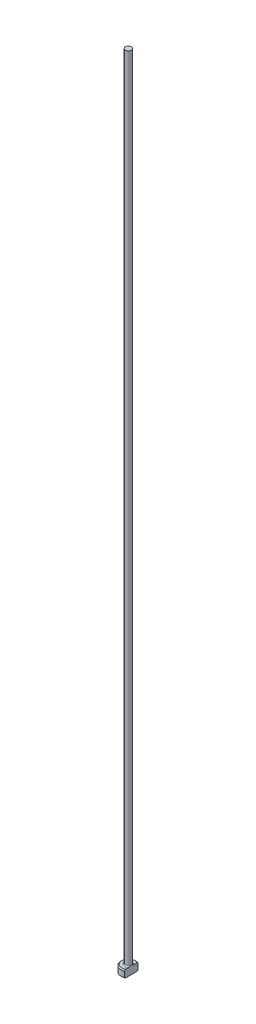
ISO-10303-21;
HEADER;
FILE_DESCRIPTION(('STEP AP214'),'2;1');
FILE_NAME('part.step','',(''),(''),'','','');
FILE_SCHEMA(('AUTOMOTIVE_DESIGN { 1 0 10303 214 1 1 1 1 }'));
ENDSEC;
DATA;
#1=APPLICATION_CONTEXT('core data for automotive mechanical design processes');
#2=APPLICATION_PROTOCOL_DEFINITION('international standard','automotive_design',2000,#1);
#3=PRODUCT_CONTEXT('',#1,'mechanical');
#4=PRODUCT('Part','Part','',(#3));
#5=PRODUCT_RELATED_PRODUCT_CATEGORY('part','',(#4));
#6=PRODUCT_DEFINITION_FORMATION('','',#4);
#7=PRODUCT_DEFINITION_CONTEXT('part definition',#1,'design');
#8=PRODUCT_DEFINITION('design','',#6,#7);
#9=PRODUCT_DEFINITION_SHAPE('','',#8);
#10=(LENGTH_UNIT() NAMED_UNIT(*) SI_UNIT(.MILLI.,.METRE.));
#11=(NAMED_UNIT(*) PLANE_ANGLE_UNIT() SI_UNIT($,.RADIAN.));
#12=(NAMED_UNIT(*) SI_UNIT($,.STERADIAN.) SOLID_ANGLE_UNIT());
#13=UNCERTAINTY_MEASURE_WITH_UNIT(LENGTH_MEASURE(1.E-05),#10,'distance_accuracy_value','');
#14=(GEOMETRIC_REPRESENTATION_CONTEXT(3) GLOBAL_UNCERTAINTY_ASSIGNED_CONTEXT((#13)) GLOBAL_UNIT_ASSIGNED_CONTEXT((#10,
#11,#12)) REPRESENTATION_CONTEXT('',''));
#15=CARTESIAN_POINT('',(0.,0.,0.));
#16=DIRECTION('',(0.,0.,1.));
#17=DIRECTION('',(1.,0.,0.));
#18=AXIS2_PLACEMENT_3D('',#15,#16,#17);
#19=CARTESIAN_POINT('',(0.,0.,0.));
#20=DIRECTION('',(0.,-1.,0.));
#21=DIRECTION('',(0.,0.,-1.));
#22=AXIS2_PLACEMENT_3D('',#19,#20,#21);
#23=PLANE('',#22);
#24=CARTESIAN_POINT('',(0.,0.,0.));
#25=DIRECTION('',(0.,-1.,0.));
#26=DIRECTION('',(0.,0.,-1.));
#27=AXIS2_PLACEMENT_3D('',#24,#25,#26);
#28=CIRCLE('',#27,1.29999999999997);
#29=CARTESIAN_POINT('',(0.599999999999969,0.,1.15325625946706));
#30=VERTEX_POINT('',#29);
#31=CARTESIAN_POINT('',(0.599999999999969,0.,-1.15325625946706));
#32=VERTEX_POINT('',#31);
#33=EDGE_CURVE('E98',#30,#32,#28,.T.);
#34=ORIENTED_EDGE('',*,*,#33,.T.);
#35=DIRECTION('',(0.,0.,1.));
#36=VECTOR('',#35,1.);
#37=CARTESIAN_POINT('',(0.599999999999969,0.,-1.37477270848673));
#38=LINE('',#37,#36);
#39=EDGE_CURVE('E83',#32,#30,#38,.T.);
#40=ORIENTED_EDGE('',*,*,#39,.T.);
#41=EDGE_LOOP('',(#34,#40));
#42=FACE_BOUND('',#41,.T.);
#43=ADVANCED_FACE('F32',(#42),#23,.T.);
#44=CARTESIAN_POINT('',(0.,259.958771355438,0.));
#45=DIRECTION('',(0.,1.,0.));
#46=DIRECTION('',(0.,0.,1.));
#47=AXIS2_PLACEMENT_3D('',#44,#45,#46);
#48=CYLINDRICAL_SURFACE('',#47,1.49999999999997);
#49=CARTESIAN_POINT('',(0.,1.30000000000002,0.));
#50=DIRECTION('',(0.,1.,0.));
#51=DIRECTION('',(0.,0.,1.));
#52=AXIS2_PLACEMENT_3D('',#49,#50,#51);
#53=CIRCLE('',#52,1.49999999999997);
#54=CARTESIAN_POINT('',(0.599999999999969,1.30000000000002,1.37477270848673));
#55=VERTEX_POINT('',#54);
#56=CARTESIAN_POINT('',(0.599999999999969,1.30000000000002,-1.37477270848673));
#57=VERTEX_POINT('',#56);
#58=EDGE_CURVE('E104',#55,#57,#53,.F.);
#59=ORIENTED_EDGE('',*,*,#58,.T.);
#60=DIRECTION('',(0.,-1.,0.));
#61=VECTOR('',#60,1.);
#62=CARTESIAN_POINT('',(0.599999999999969,160.,-1.37477270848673));
#63=LINE('',#62,#61);
#64=CARTESIAN_POINT('',(0.599999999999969,0.200000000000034,-1.37477270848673));
#65=VERTEX_POINT('',#64);
#66=EDGE_CURVE('E183',#57,#65,#63,.T.);
#67=ORIENTED_EDGE('',*,*,#66,.T.);
#68=CARTESIAN_POINT('',(0.,0.200000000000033,0.));
#69=DIRECTION('',(0.,-1.,0.));
#70=DIRECTION('',(0.,0.,-1.));
#71=AXIS2_PLACEMENT_3D('',#68,#69,#70);
#72=CIRCLE('',#71,1.49999999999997);
#73=CARTESIAN_POINT('',(0.599999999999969,0.200000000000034,1.37477270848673));
#74=VERTEX_POINT('',#73);
#75=EDGE_CURVE('E100',#65,#74,#72,.F.);
#76=ORIENTED_EDGE('',*,*,#75,.T.);
#77=DIRECTION('',(0.,-1.,0.));
#78=VECTOR('',#77,1.);
#79=CARTESIAN_POINT('',(0.599999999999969,160.,1.37477270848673));
#80=LINE('',#79,#78);
#81=EDGE_CURVE('E93',#55,#74,#80,.T.);
#82=ORIENTED_EDGE('',*,*,#81,.F.);
#83=EDGE_LOOP('',(#59,#67,#76,#82));
#84=FACE_BOUND('',#83,.T.);
#85=ADVANCED_FACE('F158',(#84),#48,.T.);
#86=CARTESIAN_POINT('',(-1.49999999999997,1.5,0.));
#87=DIRECTION('',(0.,1.,0.));
#88=DIRECTION('',(0.,0.,1.));
#89=AXIS2_PLACEMENT_3D('',#86,#87,#88);
#90=PLANE('',#89);
#91=CARTESIAN_POINT('',(0.,1.5,0.));
#92=DIRECTION('',(0.,1.,0.));
#93=DIRECTION('',(0.,0.,1.));
#94=AXIS2_PLACEMENT_3D('',#91,#92,#93);
#95=CIRCLE('',#94,1.29999999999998);
#96=CARTESIAN_POINT('',(0.599999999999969,1.5,-1.15325625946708));
#97=VERTEX_POINT('',#96);
#98=CARTESIAN_POINT('',(0.599999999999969,1.5,1.15325625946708));
#99=VERTEX_POINT('',#98);
#100=EDGE_CURVE('E178',#97,#99,#95,.T.);
#101=ORIENTED_EDGE('',*,*,#100,.T.);
#102=DIRECTION('',(0.,0.,-1.));
#103=VECTOR('',#102,1.);
#104=CARTESIAN_POINT('',(0.599999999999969,1.5,0.));
#105=LINE('',#104,#103);
#106=CARTESIAN_POINT('',(0.599999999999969,1.49999999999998,0.529150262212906));
#107=VERTEX_POINT('',#106);
#108=EDGE_CURVE('E57',#99,#107,#105,.T.);
#109=ORIENTED_EDGE('',*,*,#108,.T.);
#110=CARTESIAN_POINT('',(0.,1.5,0.));
#111=DIRECTION('',(0.,1.,0.));
#112=DIRECTION('',(0.,0.,1.));
#113=AXIS2_PLACEMENT_3D('',#110,#111,#112);
#114=CIRCLE('',#113,0.799999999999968);
#115=CARTESIAN_POINT('',(0.599999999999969,1.49999999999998,-0.529150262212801));
#116=VERTEX_POINT('',#115);
#117=EDGE_CURVE('E107',#107,#116,#114,.F.);
#118=ORIENTED_EDGE('',*,*,#117,.T.);
#119=EDGE_CURVE('E136',#116,#97,#105,.T.);
#120=ORIENTED_EDGE('',*,*,#119,.T.);
#121=EDGE_LOOP('',(#101,#109,#118,#120));
#122=FACE_BOUND('',#121,.T.);
#123=ADVANCED_FACE('F147',(#122),#90,.T.);
#124=CARTESIAN_POINT('',(0.,1.5,0.));
#125=DIRECTION('',(0.,-1.,0.));
#126=DIRECTION('',(0.,0.,-1.));
#127=AXIS2_PLACEMENT_3D('',#124,#125,#126);
#128=CONICAL_SURFACE('',#127,1.29999999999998,0.785398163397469);
#129=ORIENTED_EDGE('',*,*,#58,.F.);
#130=CARTESIAN_POINT('',(0.599999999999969,-0.287911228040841,3.02905855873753));
#131=CARTESIAN_POINT('',(0.599999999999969,-0.213665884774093,2.9533675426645));
#132=CARTESIAN_POINT('',(0.599999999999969,-0.139470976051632,2.87762699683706));
#133=CARTESIAN_POINT('',(0.599999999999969,0.00889104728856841,2.72590281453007));
#134=CARTESIAN_POINT('',(0.599999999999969,0.0830579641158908,2.64991898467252));
#135=CARTESIAN_POINT('',(0.599999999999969,0.233054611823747,2.49590131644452));
#136=CARTESIAN_POINT('',(0.599999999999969,0.308880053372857,2.41786329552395));
#137=CARTESIAN_POINT('',(0.599999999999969,0.460177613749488,2.26166700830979));
#138=CARTESIAN_POINT('',(0.599999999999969,0.535650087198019,2.18350908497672));
#139=CARTESIAN_POINT('',(0.599999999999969,0.74759769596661,1.96314022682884));
#140=CARTESIAN_POINT('',(0.599999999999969,0.883715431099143,1.82058320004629));
#141=CARTESIAN_POINT('',(0.599999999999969,1.08677998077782,1.60489754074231));
#142=CARTESIAN_POINT('',(0.599999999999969,1.15447989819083,1.53247863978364));
#143=CARTESIAN_POINT('',(0.599999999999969,1.28906472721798,1.38697516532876));
#144=CARTESIAN_POINT('',(0.599999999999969,1.35595015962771,1.3138910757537));
#145=CARTESIAN_POINT('',(0.599999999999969,1.48698128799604,1.16833124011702));
#146=CARTESIAN_POINT('',(0.599999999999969,1.55115458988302,1.09588037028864));
#147=CARTESIAN_POINT('',(0.599999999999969,1.67776408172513,0.949120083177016));
#148=CARTESIAN_POINT('',(0.599999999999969,1.74019534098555,0.874806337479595));
#149=CARTESIAN_POINT('',(0.599999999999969,1.83074985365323,0.761537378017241));
#150=CARTESIAN_POINT('',(0.599999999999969,1.86026258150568,0.7236980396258));
#151=CARTESIAN_POINT('',(0.599999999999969,1.91795850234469,0.647023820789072));
#152=CARTESIAN_POINT('',(0.599999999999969,1.94614205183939,0.608189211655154));
#153=CARTESIAN_POINT('',(0.599999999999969,2.00040823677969,0.529306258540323));
#154=CARTESIAN_POINT('',(0.599999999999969,2.02649909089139,0.489263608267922));
#155=CARTESIAN_POINT('',(0.599999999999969,2.07554904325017,0.407318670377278));
#156=CARTESIAN_POINT('',(0.599999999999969,2.09851337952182,0.365419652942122));
#157=CARTESIAN_POINT('',(0.599999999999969,2.12324895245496,0.313139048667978));
#158=CARTESIAN_POINT('',(0.599999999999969,2.12747172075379,0.303913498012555));
#159=CARTESIAN_POINT('',(0.599999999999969,2.13565719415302,0.285343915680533));
#160=CARTESIAN_POINT('',(0.599999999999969,2.13961980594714,0.275999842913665));
#161=CARTESIAN_POINT('',(0.599999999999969,2.15107305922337,0.247792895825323));
#162=CARTESIAN_POINT('',(0.599999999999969,2.15813129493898,0.228750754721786));
#163=CARTESIAN_POINT('',(0.599999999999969,2.17074315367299,0.190486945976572));
#164=CARTESIAN_POINT('',(0.599999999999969,2.17631779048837,0.171272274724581));
#165=CARTESIAN_POINT('',(0.599999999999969,2.18584668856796,0.132432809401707));
#166=CARTESIAN_POINT('',(0.599999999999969,2.18980047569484,0.112807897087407));
#167=CARTESIAN_POINT('',(0.599999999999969,2.19592362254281,0.0728426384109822));
#168=CARTESIAN_POINT('',(0.599999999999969,2.19805268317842,0.0524959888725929));
#169=CARTESIAN_POINT('',(0.599999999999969,2.20023157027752,0.0116969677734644));
#170=CARTESIAN_POINT('',(0.599999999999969,2.20028214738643,-0.00875536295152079));
#171=CARTESIAN_POINT('',(0.599999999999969,2.19830107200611,-0.0495737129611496));
#172=CARTESIAN_POINT('',(0.599999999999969,2.19626778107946,-0.0699396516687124));
#173=CARTESIAN_POINT('',(0.599999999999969,2.19025850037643,-0.110389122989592));
#174=CARTESIAN_POINT('',(0.599999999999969,2.18628111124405,-0.130472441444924));
#175=CARTESIAN_POINT('',(0.599999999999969,2.16914542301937,-0.200965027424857));
#176=CARTESIAN_POINT('',(0.599999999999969,2.15130072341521,-0.250247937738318));
#177=CARTESIAN_POINT('',(0.599999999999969,2.119457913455,-0.32187429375));
#178=CARTESIAN_POINT('',(0.599999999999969,2.10794198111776,-0.345455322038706));
#179=CARTESIAN_POINT('',(0.599999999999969,2.08360220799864,-0.391937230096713));
#180=CARTESIAN_POINT('',(0.599999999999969,2.07077874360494,-0.414838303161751));
#181=CARTESIAN_POINT('',(0.599999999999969,2.02919739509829,-0.485443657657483));
#182=CARTESIAN_POINT('',(0.599999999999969,1.99871708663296,-0.532120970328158));
#183=CARTESIAN_POINT('',(0.599999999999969,1.93517364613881,-0.623699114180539));
#184=CARTESIAN_POINT('',(0.599999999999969,1.90210805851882,-0.668598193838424));
#185=CARTESIAN_POINT('',(0.599999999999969,1.83427181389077,-0.75726294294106));
#186=CARTESIAN_POINT('',(0.599999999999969,1.79949703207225,-0.801025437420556));
#187=CARTESIAN_POINT('',(0.599999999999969,1.72886323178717,-0.887669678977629));
#188=CARTESIAN_POINT('',(0.599999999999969,1.69300406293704,-0.930551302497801));
#189=CARTESIAN_POINT('',(0.599999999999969,1.58401668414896,-1.05861145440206));
#190=CARTESIAN_POINT('',(0.599999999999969,1.50977131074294,-1.1428361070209));
#191=CARTESIAN_POINT('',(0.599999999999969,1.35983766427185,-1.30972078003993));
#192=CARTESIAN_POINT('',(0.599999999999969,1.28415199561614,-1.39238316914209));
#193=CARTESIAN_POINT('',(0.599999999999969,1.0847319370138,-1.60770200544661));
#194=CARTESIAN_POINT('',(0.599999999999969,0.960236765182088,-1.73965289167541));
#195=CARTESIAN_POINT('',(0.599999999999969,0.709941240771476,-2.00247228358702));
#196=CARTESIAN_POINT('',(0.599999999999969,0.584140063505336,-2.1333399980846));
#197=CARTESIAN_POINT('',(0.599999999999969,0.334155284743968,-2.39196201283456));
#198=CARTESIAN_POINT('',(0.599999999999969,0.209984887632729,-2.51972907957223));
#199=CARTESIAN_POINT('',(0.599999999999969,-0.038723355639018,-2.77472098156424));
#200=CARTESIAN_POINT('',(0.599999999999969,-0.163260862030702,-2.90194614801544));
#201=CARTESIAN_POINT('',(0.599999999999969,-0.287911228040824,-3.02905855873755));
#202=B_SPLINE_CURVE_WITH_KNOTS('',3,(#130,#131,#132,#133,#134,#135,#136,#137,#138,#139,#140,
#141,#142,#143,#144,#145,#146,#147,#148,#149,#150,#151,#152,#153,#154,#155,#156,#157,#158,#159,
#160,#161,#162,#163,#164,#165,#166,#167,#168,#169,#170,#171,#172,#173,#174,#175,#176,#177,#178,
#179,#180,#181,#182,#183,#184,#185,#186,#187,#188,#189,#190,#191,#192,#193,#194,#195,#196,#197,
#198,#199,#200,#201),.UNSPECIFIED.,.F.,.F.,(4,2,2,2,2,2,2,2,2,2,2,2,2,2,2,2,2,2,2,2,2,2,2,2,2,2,
2,2,2,2,2,2,2,2,2,4),(0.,0.31807784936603,0.636618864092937,0.963045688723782,1.28899494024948,
1.88029747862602,2.17769995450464,2.47490106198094,2.76524428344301,3.05633964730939,
3.20028481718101,3.3441911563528,3.48750141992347,3.63056855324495,3.66100321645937,
3.69144873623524,3.75232470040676,3.81228598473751,3.8722647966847,3.93353641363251,
3.99478590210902,4.0560835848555,4.11742545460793,4.27361886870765,4.35234029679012,
4.43103912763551,4.59811604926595,4.76535364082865,4.93301680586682,5.10070333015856,
5.43748879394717,5.77371427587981,6.31792757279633,6.86250841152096,7.39700123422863,
7.93109866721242),.UNSPECIFIED.);
#203=EDGE_CURVE('E135',#55,#99,#202,.T.);
#204=ORIENTED_EDGE('',*,*,#203,.T.);
#205=ORIENTED_EDGE('',*,*,#100,.F.);
#206=EDGE_CURVE('E127',#97,#57,#202,.T.);
#207=ORIENTED_EDGE('',*,*,#206,.T.);
#208=EDGE_LOOP('',(#129,#204,#205,#207));
#209=FACE_BOUND('',#208,.T.);
#210=ADVANCED_FACE('F143',(#209),#128,.T.);
#211=CARTESIAN_POINT('',(0.,0.200000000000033,0.));
#212=DIRECTION('',(0.,1.,0.));
#213=DIRECTION('',(0.,0.,1.));
#214=AXIS2_PLACEMENT_3D('',#211,#212,#213);
#215=CONICAL_SURFACE('',#214,1.49999999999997,0.785398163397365);
#216=ORIENTED_EDGE('',*,*,#75,.F.);
#217=CARTESIAN_POINT('',(0.599999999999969,1.78791122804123,-3.02905855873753));
#218=CARTESIAN_POINT('',(0.599999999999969,1.71366588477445,-2.95336754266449));
#219=CARTESIAN_POINT('',(0.599999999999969,1.63947097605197,-2.87762699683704));
#220=CARTESIAN_POINT('',(0.599999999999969,1.49110895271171,-2.72590281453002));
#221=CARTESIAN_POINT('',(0.599999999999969,1.41694203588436,-2.64991898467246));
#222=CARTESIAN_POINT('',(0.599999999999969,1.26694538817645,-2.49590131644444));
#223=CARTESIAN_POINT('',(0.599999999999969,1.19111994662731,-2.41786329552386));
#224=CARTESIAN_POINT('',(0.599999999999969,1.03982238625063,-2.26166700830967));
#225=CARTESIAN_POINT('',(0.599999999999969,0.964349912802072,-2.18350908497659));
#226=CARTESIAN_POINT('',(0.599999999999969,0.752402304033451,-1.96314022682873));
#227=CARTESIAN_POINT('',(0.599999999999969,0.616284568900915,-1.8205832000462));
#228=CARTESIAN_POINT('',(0.599999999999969,0.413220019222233,-1.60489754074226));
#229=CARTESIAN_POINT('',(0.599999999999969,0.345520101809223,-1.5324786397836));
#230=CARTESIAN_POINT('',(0.599999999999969,0.210935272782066,-1.38697516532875));
#231=CARTESIAN_POINT('',(0.599999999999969,0.144049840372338,-1.31389107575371));
#232=CARTESIAN_POINT('',(0.599999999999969,0.013018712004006,-1.16833124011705));
#233=CARTESIAN_POINT('',(0.599999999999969,-0.051154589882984,-1.09588037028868));
#234=CARTESIAN_POINT('',(0.599999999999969,-0.177764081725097,-0.949120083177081));
#235=CARTESIAN_POINT('',(0.599999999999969,-0.240195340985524,-0.874806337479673));
#236=CARTESIAN_POINT('',(0.599999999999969,-0.330749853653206,-0.761537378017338));
#237=CARTESIAN_POINT('',(0.599999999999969,-0.360262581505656,-0.723698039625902));
#238=CARTESIAN_POINT('',(0.599999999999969,-0.417958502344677,-0.647023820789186));
#239=CARTESIAN_POINT('',(0.599999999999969,-0.446142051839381,-0.608189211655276));
#240=CARTESIAN_POINT('',(0.599999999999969,-0.500408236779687,-0.529306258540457));
#241=CARTESIAN_POINT('',(0.599999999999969,-0.526499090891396,-0.489263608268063));
#242=CARTESIAN_POINT('',(0.599999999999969,-0.575549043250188,-0.407318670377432));
#243=CARTESIAN_POINT('',(0.599999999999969,-0.598513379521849,-0.365419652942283));
#244=CARTESIAN_POINT('',(0.599999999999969,-0.623248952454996,-0.313139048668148));
#245=CARTESIAN_POINT('',(0.599999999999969,-0.627471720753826,-0.303913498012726));
#246=CARTESIAN_POINT('',(0.599999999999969,-0.635657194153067,-0.285343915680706));
#247=CARTESIAN_POINT('',(0.599999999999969,-0.639619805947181,-0.275999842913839));
#248=CARTESIAN_POINT('',(0.599999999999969,-0.651073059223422,-0.2477928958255));
#249=CARTESIAN_POINT('',(0.599999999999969,-0.65813129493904,-0.228750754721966));
#250=CARTESIAN_POINT('',(0.599999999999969,-0.670743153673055,-0.190486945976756));
#251=CARTESIAN_POINT('',(0.599999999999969,-0.676317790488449,-0.171272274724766));
#252=CARTESIAN_POINT('',(0.599999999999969,-0.685846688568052,-0.132432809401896));
#253=CARTESIAN_POINT('',(0.599999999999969,-0.689800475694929,-0.112807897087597));
#254=CARTESIAN_POINT('',(0.599999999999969,-0.695923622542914,-0.0728426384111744));
#255=CARTESIAN_POINT('',(0.599999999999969,-0.69805268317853,-0.0524959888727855));
#256=CARTESIAN_POINT('',(0.599999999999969,-0.700231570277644,-0.0116969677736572));
#257=CARTESIAN_POINT('',(0.599999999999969,-0.700282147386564,0.0087553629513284));
#258=CARTESIAN_POINT('',(0.599999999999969,-0.698301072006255,0.0495737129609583));
#259=CARTESIAN_POINT('',(0.599999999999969,-0.696267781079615,0.0699396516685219));
#260=CARTESIAN_POINT('',(0.599999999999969,-0.690258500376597,0.110389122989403));
#261=CARTESIAN_POINT('',(0.599999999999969,-0.68628111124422,0.130472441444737));
#262=CARTESIAN_POINT('',(0.599999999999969,-0.669145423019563,0.200965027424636));
#263=CARTESIAN_POINT('',(0.599999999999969,-0.651300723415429,0.250247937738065));
#264=CARTESIAN_POINT('',(0.599999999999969,-0.619457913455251,0.321874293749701));
#265=CARTESIAN_POINT('',(0.599999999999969,-0.607941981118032,0.345455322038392));
#266=CARTESIAN_POINT('',(0.599999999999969,-0.583602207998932,0.391937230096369));
#267=CARTESIAN_POINT('',(0.599999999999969,-0.57077874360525,0.414838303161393));
#268=CARTESIAN_POINT('',(0.599999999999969,-0.529197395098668,0.48544365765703));
#269=CARTESIAN_POINT('',(0.599999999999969,-0.498717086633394,0.532120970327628));
#270=CARTESIAN_POINT('',(0.599999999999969,-0.435173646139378,0.62369911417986));
#271=CARTESIAN_POINT('',(0.599999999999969,-0.402108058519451,0.668598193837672));
#272=CARTESIAN_POINT('',(0.599999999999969,-0.334271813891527,0.757262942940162));
#273=CARTESIAN_POINT('',(0.599999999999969,-0.299497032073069,0.801025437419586));
#274=CARTESIAN_POINT('',(0.599999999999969,-0.228863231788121,0.887669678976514));
#275=CARTESIAN_POINT('',(0.599999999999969,-0.193004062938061,0.930551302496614));
#276=CARTESIAN_POINT('',(0.599999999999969,-0.0840166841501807,1.05861145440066));
#277=CARTESIAN_POINT('',(0.599999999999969,-0.00977131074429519,1.14283610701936));
#278=CARTESIAN_POINT('',(0.599999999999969,0.140162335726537,1.3097207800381));
#279=CARTESIAN_POINT('',(0.599999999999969,0.215848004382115,1.39238316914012));
#280=CARTESIAN_POINT('',(0.599999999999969,0.415268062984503,1.6077020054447));
#281=CARTESIAN_POINT('',(0.599999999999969,0.539763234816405,1.73965289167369));
#282=CARTESIAN_POINT('',(0.599999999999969,0.790058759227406,2.00247228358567));
#283=CARTESIAN_POINT('',(0.599999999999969,0.915859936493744,2.13333999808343));
#284=CARTESIAN_POINT('',(0.599999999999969,1.16584471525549,2.39196201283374));
#285=CARTESIAN_POINT('',(0.599999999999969,1.29001511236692,2.51972907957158));
#286=CARTESIAN_POINT('',(0.599999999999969,1.53872335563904,2.77472098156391));
#287=CARTESIAN_POINT('',(0.599999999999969,1.66326086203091,2.90194614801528));
#288=CARTESIAN_POINT('',(0.599999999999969,1.78791122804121,3.02905855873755));
#289=B_SPLINE_CURVE_WITH_KNOTS('',3,(#217,#218,#219,#220,#221,#222,#223,#224,#225,#226,#227,
#228,#229,#230,#231,#232,#233,#234,#235,#236,#237,#238,#239,#240,#241,#242,#243,#244,#245,#246,
#247,#248,#249,#250,#251,#252,#253,#254,#255,#256,#257,#258,#259,#260,#261,#262,#263,#264,#265,
#266,#267,#268,#269,#270,#271,#272,#273,#274,#275,#276,#277,#278,#279,#280,#281,#282,#283,#284,
#285,#286,#287,#288),.UNSPECIFIED.,.F.,.F.,(4,2,2,2,2,2,2,2,2,2,2,2,2,2,2,2,2,2,2,2,2,2,2,2,2,2,
2,2,2,2,2,2,2,2,2,4),(0.,0.318077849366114,0.636618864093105,0.963045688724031,1.28899494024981,
1.8802974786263,2.17769995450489,2.47490106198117,2.76524428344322,3.05633964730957,
3.20028481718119,3.34419115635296,3.48750141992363,3.6305685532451,3.66100321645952,
3.69144873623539,3.75232470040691,3.81228598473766,3.87226479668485,3.93353641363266,
3.99478590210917,4.05608358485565,4.11742545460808,4.27361886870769,4.3523402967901,
4.43103912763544,4.59811604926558,4.76535364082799,4.93301680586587,5.10070333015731,
5.43748879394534,5.7737142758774,6.31792757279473,6.86250841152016,7.39700123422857,
7.93109866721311),.UNSPECIFIED.);
#290=EDGE_CURVE('E86',#65,#32,#289,.T.);
#291=ORIENTED_EDGE('',*,*,#290,.T.);
#292=ORIENTED_EDGE('',*,*,#33,.F.);
#293=EDGE_CURVE('E89',#30,#74,#289,.T.);
#294=ORIENTED_EDGE('',*,*,#293,.T.);
#295=EDGE_LOOP('',(#216,#291,#292,#294));
#296=FACE_BOUND('',#295,.T.);
#297=ADVANCED_FACE('F97',(#296),#215,.T.);
#298=CARTESIAN_POINT('',(0.,1.69999999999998,0.));
#299=DIRECTION('',(0.,1.,0.));
#300=DIRECTION('',(0.,0.,1.));
#301=AXIS2_PLACEMENT_3D('',#298,#299,#300);
#302=TOROIDAL_SURFACE('',#301,0.799999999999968,0.2);
#303=CARTESIAN_POINT('',(0.599999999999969,1.69999999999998,0.));
#304=CARTESIAN_POINT('',(0.599999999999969,1.70000053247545,-1.15141187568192E-09));
#305=CARTESIAN_POINT('',(0.599999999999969,1.7000010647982,-7.219196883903E-08));
#306=CARTESIAN_POINT('',(0.599999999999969,1.7000021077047,-3.14257979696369E-07));
#307=CARTESIAN_POINT('',(0.599999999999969,1.70000261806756,-4.86120590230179E-07));
#308=CARTESIAN_POINT('',(0.599999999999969,1.7000036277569,-9.06941793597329E-07));
#309=CARTESIAN_POINT('',(0.599999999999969,1.70000412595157,-1.15855012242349E-06));
#310=CARTESIAN_POINT('',(0.599999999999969,1.70000508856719,-1.71575006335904E-06));
#311=CARTESIAN_POINT('',(0.599999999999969,1.70000555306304,-2.02121642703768E-06));
#312=CARTESIAN_POINT('',(0.599999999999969,1.70000702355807,-3.0728939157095E-06));
#313=CARTESIAN_POINT('',(0.599999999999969,1.70000797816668,-3.89144376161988E-06));
#314=CARTESIAN_POINT('',(0.599999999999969,1.70000975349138,-5.63270191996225E-06));
#315=CARTESIAN_POINT('',(0.599999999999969,1.70001057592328,-6.55375773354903E-06));
#316=CARTESIAN_POINT('',(0.599999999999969,1.70001343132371,-9.94112080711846E-06));
#317=CARTESIAN_POINT('',(0.599999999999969,1.70001531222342,-1.25381888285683E-05));
#318=CARTESIAN_POINT('',(0.599999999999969,1.70001859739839,-1.7822708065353E-05));
#319=CARTESIAN_POINT('',(0.599999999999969,1.70002002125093,-2.04985914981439E-05));
#320=CARTESIAN_POINT('',(0.599999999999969,1.70002561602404,-3.12399873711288E-05));
#321=CARTESIAN_POINT('',(0.599999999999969,1.70002959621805,-3.94002328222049E-05));
#322=CARTESIAN_POINT('',(0.599999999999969,1.70003641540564,-5.5052909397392E-05));
#323=CARTESIAN_POINT('',(0.599999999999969,1.70003933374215,-6.25098783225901E-05));
#324=CARTESIAN_POINT('',(0.599999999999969,1.70006102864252,-0.000113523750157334));
#325=CARTESIAN_POINT('',(0.599999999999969,1.7000869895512,-0.000153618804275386));
#326=CARTESIAN_POINT('',(0.599999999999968,1.70018105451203,-0.000305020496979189));
#327=CARTESIAN_POINT('',(0.599999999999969,1.70024383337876,-0.000418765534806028));
#328=CARTESIAN_POINT('',(0.599999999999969,1.7004829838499,-0.000844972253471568));
#329=CARTESIAN_POINT('',(0.599999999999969,1.70066486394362,-0.00115493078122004));
#330=CARTESIAN_POINT('',(0.599999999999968,1.70138503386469,-0.00238898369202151));
#331=CARTESIAN_POINT('',(0.599999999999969,1.7019171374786,-0.0033158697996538));
#332=CARTESIAN_POINT('',(0.599999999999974,1.71148793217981,-0.0199795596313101));
#333=CARTESIAN_POINT('',(0.59999999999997,1.72058486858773,-0.0356908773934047));
#334=CARTESIAN_POINT('',(0.599999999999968,1.73832586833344,-0.0667184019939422));
#335=CARTESIAN_POINT('',(0.599999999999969,1.74697521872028,-0.082031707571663));
#336=CARTESIAN_POINT('',(0.599999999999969,1.76488296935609,-0.114323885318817));
#337=CARTESIAN_POINT('',(0.599999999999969,1.77411633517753,-0.131316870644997));
#338=CARTESIAN_POINT('',(0.599999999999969,1.79218965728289,-0.165698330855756));
#339=CARTESIAN_POINT('',(0.599999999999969,1.80102554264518,-0.18308895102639));
#340=CARTESIAN_POINT('',(0.599999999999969,1.8226392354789,-0.227696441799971));
#341=CARTESIAN_POINT('',(0.599999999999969,1.83496283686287,-0.255138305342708));
#342=CARTESIAN_POINT('',(0.599999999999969,1.85701285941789,-0.310418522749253));
#343=CARTESIAN_POINT('',(0.599999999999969,1.86678784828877,-0.33823684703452));
#344=CARTESIAN_POINT('',(0.599999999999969,1.87956548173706,-0.382495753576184));
#345=CARTESIAN_POINT('',(0.599999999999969,1.88366362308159,-0.398615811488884));
#346=CARTESIAN_POINT('',(0.599999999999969,1.89064725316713,-0.431187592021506));
#347=CARTESIAN_POINT('',(0.599999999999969,1.89352682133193,-0.447640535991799));
#348=CARTESIAN_POINT('',(0.599999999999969,1.90011661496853,-0.498574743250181));
#349=CARTESIAN_POINT('',(0.599999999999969,1.90140980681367,-0.533480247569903));
#350=CARTESIAN_POINT('',(0.599999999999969,1.89686480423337,-0.58352985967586));
#351=CARTESIAN_POINT('',(0.599999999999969,1.89454911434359,-0.599011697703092));
#352=CARTESIAN_POINT('',(0.599999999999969,1.88786997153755,-0.629428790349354));
#353=CARTESIAN_POINT('',(0.599999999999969,1.88352170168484,-0.644367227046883));
#354=CARTESIAN_POINT('',(0.599999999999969,1.87245798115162,-0.673599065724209));
#355=CARTESIAN_POINT('',(0.599999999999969,1.86571024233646,-0.687880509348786));
#356=CARTESIAN_POINT('',(0.599999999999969,1.84965008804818,-0.714957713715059));
#357=CARTESIAN_POINT('',(0.599999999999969,1.84033955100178,-0.72775455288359));
#358=CARTESIAN_POINT('',(0.599999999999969,1.82259590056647,-0.74723695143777));
#359=CARTESIAN_POINT('',(0.599999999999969,1.81485840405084,-0.754558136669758));
#360=CARTESIAN_POINT('',(0.599999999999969,1.79828948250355,-0.767841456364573));
#361=CARTESIAN_POINT('',(0.599999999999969,1.78945892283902,-0.77380465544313));
#362=CARTESIAN_POINT('',(0.599999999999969,1.7708054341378,-0.78410586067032));
#363=CARTESIAN_POINT('',(0.599999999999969,1.76097594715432,-0.788432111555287));
#364=CARTESIAN_POINT('',(0.599999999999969,1.74066851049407,-0.795124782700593));
#365=CARTESIAN_POINT('',(0.599999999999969,1.73019096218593,-0.797492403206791));
#366=CARTESIAN_POINT('',(0.599999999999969,1.71019102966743,-0.799954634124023));
#367=CARTESIAN_POINT('',(0.599999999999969,1.70069636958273,-0.800278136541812));
#368=CARTESIAN_POINT('',(0.599999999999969,1.68180115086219,-0.79924295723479));
#369=CARTESIAN_POINT('',(0.599999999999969,1.67240056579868,-0.79788476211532));
#370=CARTESIAN_POINT('',(0.599999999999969,1.65439769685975,-0.793663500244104));
#371=CARTESIAN_POINT('',(0.599999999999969,1.64577854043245,-0.790871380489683));
#372=CARTESIAN_POINT('',(0.599999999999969,1.62909204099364,-0.783962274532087));
#373=CARTESIAN_POINT('',(0.599999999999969,1.62102476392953,-0.779845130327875));
#374=CARTESIAN_POINT('',(0.599999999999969,1.60511409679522,-0.770167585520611));
#375=CARTESIAN_POINT('',(0.599999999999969,1.59731583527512,-0.764533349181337));
#376=CARTESIAN_POINT('',(0.599999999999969,1.58262481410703,-0.752193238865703));
#377=CARTESIAN_POINT('',(0.599999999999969,1.57573246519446,-0.745486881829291));
#378=CARTESIAN_POINT('',(0.599999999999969,1.560298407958,-0.728319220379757));
#379=CARTESIAN_POINT('',(0.599999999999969,1.55222187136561,-0.717438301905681));
#380=CARTESIAN_POINT('',(0.599999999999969,1.53794452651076,-0.694498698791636));
#381=CARTESIAN_POINT('',(0.599999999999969,1.53174853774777,-0.682437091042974));
#382=CARTESIAN_POINT('',(0.599999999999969,1.51926782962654,-0.653177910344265));
#383=CARTESIAN_POINT('',(0.599999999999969,1.51371982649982,-0.635667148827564));
#384=CARTESIAN_POINT('',(0.599999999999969,1.50550234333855,-0.600065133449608));
#385=CARTESIAN_POINT('',(0.599999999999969,1.50282657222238,-0.58197523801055));
#386=CARTESIAN_POINT('',(0.599999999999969,1.49919226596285,-0.536773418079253));
#387=CARTESIAN_POINT('',(0.599999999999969,1.49969917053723,-0.509547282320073));
#388=CARTESIAN_POINT('',(0.599999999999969,1.50488342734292,-0.455047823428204));
#389=CARTESIAN_POINT('',(0.599999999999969,1.50964012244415,-0.427783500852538));
#390=CARTESIAN_POINT('',(0.599999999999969,1.52379077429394,-0.367993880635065));
#391=CARTESIAN_POINT('',(0.599999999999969,1.53398732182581,-0.335665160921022));
#392=CARTESIAN_POINT('',(0.599999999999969,1.55767895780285,-0.272220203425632));
#393=CARTESIAN_POINT('',(0.599999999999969,1.5711810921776,-0.241106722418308));
#394=CARTESIAN_POINT('',(0.599999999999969,1.59908908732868,-0.182423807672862));
#395=CARTESIAN_POINT('',(0.599999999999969,1.61332903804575,-0.154773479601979));
#396=CARTESIAN_POINT('',(0.599999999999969,1.64269458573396,-0.100300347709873));
#397=CARTESIAN_POINT('',(0.59999999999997,1.65781032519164,-0.0734721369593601));
#398=CARTESIAN_POINT('',(0.599999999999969,1.67666349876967,-0.040501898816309));
#399=CARTESIAN_POINT('',(0.599999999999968,1.68024190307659,-0.0342655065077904));
#400=CARTESIAN_POINT('',(0.599999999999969,1.68840215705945,-0.0201022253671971));
#401=CARTESIAN_POINT('',(0.599999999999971,1.6929910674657,-0.0121789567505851));
#402=CARTESIAN_POINT('',(0.599999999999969,1.69807754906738,-0.00332537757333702));
#403=CARTESIAN_POINT('',(0.599999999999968,1.69860414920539,-0.00240791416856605));
#404=CARTESIAN_POINT('',(0.599999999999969,1.69932276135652,-0.00117640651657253));
#405=CARTESIAN_POINT('',(0.599999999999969,1.6995086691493,-0.000859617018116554));
#406=CARTESIAN_POINT('',(0.599999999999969,1.6997528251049,-0.000424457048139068));
#407=CARTESIAN_POINT('',(0.599999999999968,1.69981673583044,-0.000308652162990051));
#408=CARTESIAN_POINT('',(0.599999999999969,1.69991233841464,-0.000154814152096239));
#409=CARTESIAN_POINT('',(0.599999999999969,1.69993857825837,-0.000114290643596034));
#410=CARTESIAN_POINT('',(0.599999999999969,1.69996044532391,-6.2754014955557E-05));
#411=CARTESIAN_POINT('',(0.599999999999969,1.69996337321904,-5.5254638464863E-05));
#412=CARTESIAN_POINT('',(0.599999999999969,1.69997022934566,-3.95134343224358E-05));
#413=CARTESIAN_POINT('',(0.599999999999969,1.69997423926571,-3.13080766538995E-05));
#414=CARTESIAN_POINT('',(0.599999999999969,1.6999798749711,-2.05158222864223E-05));
#415=CARTESIAN_POINT('',(0.599999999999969,1.6999813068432,-1.78321761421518E-05));
#416=CARTESIAN_POINT('',(0.599999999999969,1.69998461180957,-1.25338082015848E-05));
#417=CARTESIAN_POINT('',(0.599999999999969,1.69998650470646,-9.93082533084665E-06));
#418=CARTESIAN_POINT('',(0.599999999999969,1.69998937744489,-6.53827382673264E-06));
#419=CARTESIAN_POINT('',(0.599999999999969,1.69999020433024,-5.61654145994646E-06));
#420=CARTESIAN_POINT('',(0.599999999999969,1.69999198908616,-3.87485641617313E-06));
#421=CARTESIAN_POINT('',(0.599999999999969,1.69999294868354,-3.05657498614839E-06));
#422=CARTESIAN_POINT('',(0.599999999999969,1.69999442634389,-2.00636330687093E-06));
#423=CARTESIAN_POINT('',(0.599999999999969,1.69999489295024,-1.70153920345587E-06));
#424=CARTESIAN_POINT('',(0.599999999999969,1.69999585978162,-1.14598742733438E-06));
#425=CARTESIAN_POINT('',(0.599999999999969,1.69999636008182,-8.95386349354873E-07));
#426=CARTESIAN_POINT('',(0.599999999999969,1.6999973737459,-4.77020032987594E-07));
#427=CARTESIAN_POINT('',(0.599999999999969,1.69999788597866,-3.06581134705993E-07));
#428=CARTESIAN_POINT('',(0.599999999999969,1.69999893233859,-6.79168066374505E-08));
#429=CARTESIAN_POINT('',(0.599999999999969,1.69999946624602,1.15417644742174E-09));
#430=CARTESIAN_POINT('',(0.599999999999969,1.69999999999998,0.));
#431=B_SPLINE_CURVE_WITH_KNOTS('',3,(#303,#304,#305,#306,#307,#308,#309,#310,#311,#312,#313,
#314,#315,#316,#317,#318,#319,#320,#321,#322,#323,#324,#325,#326,#327,#328,#329,#330,#331,#332,
#333,#334,#335,#336,#337,#338,#339,#340,#341,#342,#343,#344,#345,#346,#347,#348,#349,#350,#351,
#352,#353,#354,#355,#356,#357,#358,#359,#360,#361,#362,#363,#364,#365,#366,#367,#368,#369,#370,
#371,#372,#373,#374,#375,#376,#377,#378,#379,#380,#381,#382,#383,#384,#385,#386,#387,#388,#389,
#390,#391,#392,#393,#394,#395,#396,#397,#398,#399,#400,#401,#402,#403,#404,#405,#406,#407,#408,
#409,#410,#411,#412,#413,#414,#415,#416,#417,#418,#419,#420,#421,#422,#423,#424,#425,#426,#427,
#428,#429,#430),.UNSPECIFIED.,.T.,.F.,(4,2,2,2,2,2,2,2,2,2,2,2,2,2,2,2,2,2,2,2,2,2,2,2,2,2,2,2,
2,2,2,2,2,2,2,2,2,2,2,2,2,2,2,2,2,2,2,2,2,2,2,2,2,2,2,2,2,2,2,2,2,2,2,4),(0.,
1.59574446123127E-06,3.20493026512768E-06,4.87446851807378E-06,6.54017422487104E-06,
1.02946977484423E-05,1.39956597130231E-05,2.35749064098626E-05,3.26601537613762E-05,
5.98833376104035E-05,8.38803593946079E-05,0.000226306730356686,0.000616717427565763,
0.00169407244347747,0.00490113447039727,0.0593566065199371,0.112119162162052,0.170131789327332,
0.228643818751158,0.318818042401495,0.407121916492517,0.45697288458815,0.507063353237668,
0.610835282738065,0.657688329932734,0.704196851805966,0.751356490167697,0.798481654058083,
0.83031525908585,0.862123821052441,0.894156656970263,0.926169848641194,0.954523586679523,
0.982869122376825,1.00993079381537,1.03699569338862,1.06574384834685,1.09450499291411,
1.13493371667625,1.17546519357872,1.23026604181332,1.28494661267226,1.36618745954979,
1.44897750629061,1.55039579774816,1.6520321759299,1.74530129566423,1.83767157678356,
1.85924264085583,1.88670680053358,1.88988115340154,1.89098226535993,1.89137974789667,
1.89152369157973,1.89154781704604,1.89157519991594,1.8915843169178,1.89159393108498,
1.89159764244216,1.89160140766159,1.89160307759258,1.89160475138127,1.89160636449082,
1.89160796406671),.UNSPECIFIED.);
#432=CARTESIAN_POINT('',(0.599999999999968,1.69999999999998,0.));
#433=VERTEX_POINT('',#432);
#434=EDGE_CURVE('E11',#116,#433,#431,.T.);
#435=ORIENTED_EDGE('',*,*,#434,.F.);
#436=ORIENTED_EDGE('',*,*,#117,.F.);
#437=CARTESIAN_POINT('',(0.599999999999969,1.69999999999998,0.));
#438=CARTESIAN_POINT('',(0.599999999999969,1.6999994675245,1.15141190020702E-09));
#439=CARTESIAN_POINT('',(0.599999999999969,1.69999893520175,7.21919688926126E-08));
#440=CARTESIAN_POINT('',(0.599999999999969,1.69999789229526,3.14257979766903E-07));
#441=CARTESIAN_POINT('',(0.599999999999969,1.6999973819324,4.86120590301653E-07));
#442=CARTESIAN_POINT('',(0.599999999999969,1.69999637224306,9.06941793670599E-07));
#443=CARTESIAN_POINT('',(0.599999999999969,1.69999587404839,1.15855012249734E-06));
#444=CARTESIAN_POINT('',(0.599999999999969,1.69999491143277,1.71575006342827E-06));
#445=CARTESIAN_POINT('',(0.599999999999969,1.69999444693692,2.02121642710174E-06));
#446=CARTESIAN_POINT('',(0.599999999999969,1.69999297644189,3.07289391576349E-06));
#447=CARTESIAN_POINT('',(0.599999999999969,1.69999202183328,3.89144376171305E-06));
#448=CARTESIAN_POINT('',(0.599999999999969,1.69999024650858,5.6327019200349E-06));
#449=CARTESIAN_POINT('',(0.599999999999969,1.69998942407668,6.55375773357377E-06));
#450=CARTESIAN_POINT('',(0.599999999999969,1.69998656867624,9.94112080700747E-06));
#451=CARTESIAN_POINT('',(0.599999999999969,1.69998468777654,1.25381888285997E-05));
#452=CARTESIAN_POINT('',(0.599999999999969,1.69998140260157,1.78227080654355E-05));
#453=CARTESIAN_POINT('',(0.599999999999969,1.69997997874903,2.04985914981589E-05));
#454=CARTESIAN_POINT('',(0.599999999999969,1.69997438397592,3.12399873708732E-05));
#455=CARTESIAN_POINT('',(0.599999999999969,1.69997040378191,3.94002328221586E-05));
#456=CARTESIAN_POINT('',(0.599999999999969,1.69996358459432,5.50529093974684E-05));
#457=CARTESIAN_POINT('',(0.599999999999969,1.69996066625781,6.25098783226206E-05));
#458=CARTESIAN_POINT('',(0.599999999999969,1.69993897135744,0.000113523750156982));
#459=CARTESIAN_POINT('',(0.599999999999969,1.69991301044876,0.00015361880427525));
#460=CARTESIAN_POINT('',(0.599999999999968,1.69981894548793,0.000305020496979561));
#461=CARTESIAN_POINT('',(0.599999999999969,1.6997561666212,0.000418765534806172));
#462=CARTESIAN_POINT('',(0.599999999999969,1.69951701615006,0.000844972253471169));
#463=CARTESIAN_POINT('',(0.599999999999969,1.69933513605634,0.00115493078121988));
#464=CARTESIAN_POINT('',(0.599999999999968,1.69861496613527,0.00238898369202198));
#465=CARTESIAN_POINT('',(0.599999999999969,1.69808286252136,0.00331586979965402));
#466=CARTESIAN_POINT('',(0.599999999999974,1.68851206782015,0.0199795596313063));
#467=CARTESIAN_POINT('',(0.59999999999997,1.67941513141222,0.0356908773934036));
#468=CARTESIAN_POINT('',(0.599999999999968,1.66167413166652,0.0667184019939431));
#469=CARTESIAN_POINT('',(0.599999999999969,1.65302478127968,0.0820317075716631));
#470=CARTESIAN_POINT('',(0.599999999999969,1.63511703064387,0.114323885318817));
#471=CARTESIAN_POINT('',(0.599999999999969,1.62588366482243,0.131316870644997));
#472=CARTESIAN_POINT('',(0.599999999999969,1.60781034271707,0.165698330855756));
#473=CARTESIAN_POINT('',(0.599999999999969,1.59897445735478,0.18308895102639));
#474=CARTESIAN_POINT('',(0.599999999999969,1.57736076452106,0.227696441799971));
#475=CARTESIAN_POINT('',(0.599999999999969,1.56503716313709,0.255138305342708));
#476=CARTESIAN_POINT('',(0.599999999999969,1.54298714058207,0.310418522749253));
#477=CARTESIAN_POINT('',(0.599999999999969,1.53321215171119,0.33823684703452));
#478=CARTESIAN_POINT('',(0.599999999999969,1.5204345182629,0.382495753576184));
#479=CARTESIAN_POINT('',(0.599999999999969,1.51633637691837,0.398615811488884));
#480=CARTESIAN_POINT('',(0.599999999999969,1.50935274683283,0.431187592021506));
#481=CARTESIAN_POINT('',(0.599999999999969,1.50647317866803,0.4476405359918));
#482=CARTESIAN_POINT('',(0.599999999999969,1.49988338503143,0.498574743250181));
#483=CARTESIAN_POINT('',(0.599999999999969,1.49859019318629,0.533480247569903));
#484=CARTESIAN_POINT('',(0.599999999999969,1.50313519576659,0.58352985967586));
#485=CARTESIAN_POINT('',(0.599999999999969,1.50545088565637,0.599011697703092));
#486=CARTESIAN_POINT('',(0.599999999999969,1.51213002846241,0.629428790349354));
#487=CARTESIAN_POINT('',(0.599999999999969,1.51647829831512,0.644367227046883));
#488=CARTESIAN_POINT('',(0.599999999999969,1.52754201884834,0.673599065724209));
#489=CARTESIAN_POINT('',(0.599999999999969,1.5342897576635,0.687880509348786));
#490=CARTESIAN_POINT('',(0.599999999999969,1.55034991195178,0.714957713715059));
#491=CARTESIAN_POINT('',(0.599999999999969,1.55966044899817,0.72775455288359));
#492=CARTESIAN_POINT('',(0.599999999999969,1.57740409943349,0.74723695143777));
#493=CARTESIAN_POINT('',(0.599999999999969,1.58514159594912,0.754558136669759));
#494=CARTESIAN_POINT('',(0.599999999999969,1.60171051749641,0.767841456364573));
#495=CARTESIAN_POINT('',(0.599999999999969,1.61054107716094,0.77380465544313));
#496=CARTESIAN_POINT('',(0.599999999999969,1.62919456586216,0.78410586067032));
#497=CARTESIAN_POINT('',(0.599999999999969,1.63902405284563,0.788432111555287));
#498=CARTESIAN_POINT('',(0.599999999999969,1.65933148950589,0.795124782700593));
#499=CARTESIAN_POINT('',(0.599999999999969,1.66980903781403,0.797492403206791));
#500=CARTESIAN_POINT('',(0.599999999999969,1.68980897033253,0.799954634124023));
#501=CARTESIAN_POINT('',(0.599999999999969,1.69930363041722,0.800278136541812));
#502=CARTESIAN_POINT('',(0.599999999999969,1.71819884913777,0.79924295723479));
#503=CARTESIAN_POINT('',(0.599999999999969,1.72759943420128,0.79788476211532));
#504=CARTESIAN_POINT('',(0.599999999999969,1.74560230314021,0.793663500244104));
#505=CARTESIAN_POINT('',(0.599999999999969,1.75422145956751,0.790871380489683));
#506=CARTESIAN_POINT('',(0.599999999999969,1.77090795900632,0.783962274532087));
#507=CARTESIAN_POINT('',(0.599999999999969,1.77897523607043,0.779845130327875));
#508=CARTESIAN_POINT('',(0.599999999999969,1.79488590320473,0.770167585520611));
#509=CARTESIAN_POINT('',(0.599999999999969,1.80268416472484,0.764533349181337));
#510=CARTESIAN_POINT('',(0.599999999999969,1.81737518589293,0.752193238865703));
#511=CARTESIAN_POINT('',(0.599999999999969,1.8242675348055,0.745486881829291));
#512=CARTESIAN_POINT('',(0.599999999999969,1.83970159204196,0.728319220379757));
#513=CARTESIAN_POINT('',(0.599999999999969,1.84777812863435,0.717438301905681));
#514=CARTESIAN_POINT('',(0.599999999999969,1.8620554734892,0.694498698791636));
#515=CARTESIAN_POINT('',(0.599999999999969,1.86825146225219,0.682437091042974));
#516=CARTESIAN_POINT('',(0.599999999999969,1.88073217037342,0.653177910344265));
#517=CARTESIAN_POINT('',(0.599999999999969,1.88628017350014,0.635667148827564));
#518=CARTESIAN_POINT('',(0.599999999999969,1.89449765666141,0.600065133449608));
#519=CARTESIAN_POINT('',(0.599999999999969,1.89717342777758,0.58197523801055));
#520=CARTESIAN_POINT('',(0.599999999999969,1.90080773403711,0.536773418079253));
#521=CARTESIAN_POINT('',(0.599999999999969,1.90030082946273,0.509547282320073));
#522=CARTESIAN_POINT('',(0.599999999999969,1.89511657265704,0.455047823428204));
#523=CARTESIAN_POINT('',(0.599999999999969,1.89035987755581,0.427783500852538));
#524=CARTESIAN_POINT('',(0.599999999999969,1.87620922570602,0.367993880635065));
#525=CARTESIAN_POINT('',(0.599999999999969,1.86601267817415,0.335665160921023));
#526=CARTESIAN_POINT('',(0.599999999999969,1.84232104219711,0.272220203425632));
#527=CARTESIAN_POINT('',(0.599999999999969,1.82881890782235,0.241106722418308));
#528=CARTESIAN_POINT('',(0.599999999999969,1.80091091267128,0.182423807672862));
#529=CARTESIAN_POINT('',(0.599999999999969,1.78667096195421,0.154773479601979));
#530=CARTESIAN_POINT('',(0.599999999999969,1.75730541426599,0.100300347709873));
#531=CARTESIAN_POINT('',(0.59999999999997,1.74218967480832,0.0734721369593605));
#532=CARTESIAN_POINT('',(0.599999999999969,1.72333650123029,0.0405018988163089));
#533=CARTESIAN_POINT('',(0.599999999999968,1.71975809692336,0.0342655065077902));
#534=CARTESIAN_POINT('',(0.599999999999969,1.7115978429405,0.0201022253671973));
#535=CARTESIAN_POINT('',(0.599999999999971,1.70700893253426,0.012178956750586));
#536=CARTESIAN_POINT('',(0.599999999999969,1.70192245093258,0.00332537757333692));
#537=CARTESIAN_POINT('',(0.599999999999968,1.70139585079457,0.00240791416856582));
#538=CARTESIAN_POINT('',(0.599999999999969,1.70067723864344,0.00117640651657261));
#539=CARTESIAN_POINT('',(0.599999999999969,1.70049133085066,0.000859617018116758));
#540=CARTESIAN_POINT('',(0.599999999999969,1.70024717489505,0.000424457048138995));
#541=CARTESIAN_POINT('',(0.599999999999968,1.70018326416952,0.000308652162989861));
#542=CARTESIAN_POINT('',(0.599999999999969,1.70008766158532,0.000154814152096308));
#543=CARTESIAN_POINT('',(0.599999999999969,1.70006142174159,0.000114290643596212));
#544=CARTESIAN_POINT('',(0.599999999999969,1.70003955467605,6.27540149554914E-05));
#545=CARTESIAN_POINT('',(0.599999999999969,1.70003662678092,5.52546384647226E-05));
#546=CARTESIAN_POINT('',(0.599999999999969,1.7000297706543,3.95134343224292E-05));
#547=CARTESIAN_POINT('',(0.599999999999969,1.70002576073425,3.13080766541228E-05));
#548=CARTESIAN_POINT('',(0.599999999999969,1.70002012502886,2.05158222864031E-05));
#549=CARTESIAN_POINT('',(0.599999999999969,1.70001869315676,1.78321761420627E-05));
#550=CARTESIAN_POINT('',(0.599999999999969,1.70001538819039,1.25338082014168E-05));
#551=CARTESIAN_POINT('',(0.599999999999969,1.7000134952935,9.93082533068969E-06));
#552=CARTESIAN_POINT('',(0.599999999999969,1.70001062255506,6.53827382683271E-06));
#553=CARTESIAN_POINT('',(0.599999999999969,1.70000979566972,5.61654146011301E-06));
#554=CARTESIAN_POINT('',(0.599999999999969,1.7000080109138,3.87485641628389E-06));
#555=CARTESIAN_POINT('',(0.599999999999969,1.70000705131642,3.056574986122E-06));
#556=CARTESIAN_POINT('',(0.599999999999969,1.70000557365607,2.00636330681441E-06));
#557=CARTESIAN_POINT('',(0.599999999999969,1.70000510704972,1.70153920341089E-06));
#558=CARTESIAN_POINT('',(0.599999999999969,1.70000414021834,1.14598742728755E-06));
#559=CARTESIAN_POINT('',(0.599999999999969,1.70000363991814,8.95386349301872E-07));
#560=CARTESIAN_POINT('',(0.599999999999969,1.70000262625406,4.77020032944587E-07));
#561=CARTESIAN_POINT('',(0.599999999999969,1.7000021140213,3.06581134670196E-07));
#562=CARTESIAN_POINT('',(0.599999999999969,1.70000106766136,6.79168066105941E-08));
#563=CARTESIAN_POINT('',(0.599999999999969,1.70000053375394,-1.15417647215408E-09));
#564=CARTESIAN_POINT('',(0.599999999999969,1.69999999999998,0.));
#565=B_SPLINE_CURVE_WITH_KNOTS('',3,(#437,#438,#439,#440,#441,#442,#443,#444,#445,#446,#447,
#448,#449,#450,#451,#452,#453,#454,#455,#456,#457,#458,#459,#460,#461,#462,#463,#464,#465,#466,
#467,#468,#469,#470,#471,#472,#473,#474,#475,#476,#477,#478,#479,#480,#481,#482,#483,#484,#485,
#486,#487,#488,#489,#490,#491,#492,#493,#494,#495,#496,#497,#498,#499,#500,#501,#502,#503,#504,
#505,#506,#507,#508,#509,#510,#511,#512,#513,#514,#515,#516,#517,#518,#519,#520,#521,#522,#523,
#524,#525,#526,#527,#528,#529,#530,#531,#532,#533,#534,#535,#536,#537,#538,#539,#540,#541,#542,
#543,#544,#545,#546,#547,#548,#549,#550,#551,#552,#553,#554,#555,#556,#557,#558,#559,#560,#561,
#562,#563,#564),.UNSPECIFIED.,.T.,.F.,(4,2,2,2,2,2,2,2,2,2,2,2,2,2,2,2,2,2,2,2,2,2,2,2,2,2,2,2,
2,2,2,2,2,2,2,2,2,2,2,2,2,2,2,2,2,2,2,2,2,2,2,2,2,2,2,2,2,2,2,2,2,2,2,4),(0.,
1.59574446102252E-06,3.20493026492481E-06,4.87446851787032E-06,6.54017422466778E-06,
1.02946977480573E-05,1.39956597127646E-05,2.35749064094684E-05,3.26601537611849E-05,
5.98833376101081E-05,8.38803593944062E-05,0.000226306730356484,0.000616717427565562,
0.00169407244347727,0.00490113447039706,0.0593566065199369,0.112119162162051,0.170131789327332,
0.228643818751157,0.318818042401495,0.407121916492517,0.45697288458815,0.507063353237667,
0.610835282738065,0.657688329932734,0.704196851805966,0.751356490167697,0.798481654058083,
0.83031525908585,0.86212382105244,0.894156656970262,0.926169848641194,0.954523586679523,
0.982869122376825,1.00993079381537,1.03699569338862,1.06574384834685,1.09450499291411,
1.13493371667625,1.17546519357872,1.23026604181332,1.28494661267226,1.36618745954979,
1.44897750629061,1.55039579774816,1.6520321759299,1.74530129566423,1.83767157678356,
1.85924264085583,1.88670680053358,1.88988115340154,1.89098226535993,1.89137974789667,
1.89152369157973,1.89154781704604,1.89157519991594,1.8915843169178,1.89159393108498,
1.89159764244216,1.89160140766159,1.89160307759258,1.89160475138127,1.89160636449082,
1.89160796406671),.UNSPECIFIED.);
#566=EDGE_CURVE('E46',#433,#107,#565,.T.);
#567=ORIENTED_EDGE('',*,*,#566,.F.);
#568=CARTESIAN_POINT('',(0.,1.69999999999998,0.));
#569=DIRECTION('',(0.,1.,0.));
#570=DIRECTION('',(0.,0.,1.));
#571=AXIS2_PLACEMENT_3D('',#568,#569,#570);
#572=CIRCLE('',#571,0.599999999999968);
#573=EDGE_CURVE('E103',#433,#433,#572,.T.);
#574=ORIENTED_EDGE('',*,*,#573,.F.);
#575=EDGE_LOOP('',(#435,#436,#567,#574));
#576=FACE_BOUND('',#575,.T.);
#577=ADVANCED_FACE('F34',(#576),#302,.F.);
#578=CARTESIAN_POINT('',(0.,259.958771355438,0.));
#579=DIRECTION('',(0.,1.,0.));
#580=DIRECTION('',(0.,0.,1.));
#581=AXIS2_PLACEMENT_3D('',#578,#579,#580);
#582=CYLINDRICAL_SURFACE('',#581,0.599999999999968);
#583=ORIENTED_EDGE('',*,*,#573,.T.);
#584=EDGE_LOOP('',(#583));
#585=FACE_BOUND('',#584,.T.);
#586=CARTESIAN_POINT('',(0.,160.,0.));
#587=DIRECTION('',(0.,1.,0.));
#588=DIRECTION('',(0.,0.,1.));
#589=AXIS2_PLACEMENT_3D('',#586,#587,#588);
#590=CIRCLE('',#589,0.599999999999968);
#591=CARTESIAN_POINT('',(0.,160.,0.599999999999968));
#592=VERTEX_POINT('',#591);
#593=EDGE_CURVE('E101',#592,#592,#590,.T.);
#594=ORIENTED_EDGE('',*,*,#593,.F.);
#595=EDGE_LOOP('',(#594));
#596=FACE_BOUND('',#595,.T.);
#597=ADVANCED_FACE('F155',(#585,#596),#582,.T.);
#598=CARTESIAN_POINT('',(-0.599999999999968,160.,0.));
#599=DIRECTION('',(0.,1.,0.));
#600=DIRECTION('',(0.,0.,1.));
#601=AXIS2_PLACEMENT_3D('',#598,#599,#600);
#602=PLANE('',#601);
#603=ORIENTED_EDGE('',*,*,#593,.T.);
#604=EDGE_LOOP('',(#603));
#605=FACE_BOUND('',#604,.T.);
#606=ADVANCED_FACE('F121',(#605),#602,.T.);
#607=CARTESIAN_POINT('',(0.599999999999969,160.,-1.37477270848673));
#608=DIRECTION('',(1.,0.,0.));
#609=DIRECTION('',(0.,0.,-1.));
#610=AXIS2_PLACEMENT_3D('',#607,#608,#609);
#611=PLANE('',#610);
#612=ORIENTED_EDGE('',*,*,#66,.F.);
#613=ORIENTED_EDGE('',*,*,#206,.F.);
#614=ORIENTED_EDGE('',*,*,#119,.F.);
#615=ORIENTED_EDGE('',*,*,#434,.T.);
#616=ORIENTED_EDGE('',*,*,#566,.T.);
#617=ORIENTED_EDGE('',*,*,#108,.F.);
#618=ORIENTED_EDGE('',*,*,#203,.F.);
#619=ORIENTED_EDGE('',*,*,#81,.T.);
#620=ORIENTED_EDGE('',*,*,#293,.F.);
#621=ORIENTED_EDGE('',*,*,#39,.F.);
#622=ORIENTED_EDGE('',*,*,#290,.F.);
#623=EDGE_LOOP('',(#612,#613,#614,#615,#616,#617,#618,#619,#620,#621,#622));
#624=FACE_BOUND('',#623,.T.);
#625=ADVANCED_FACE('F85',(#624),#611,.T.);
#626=CLOSED_SHELL('',(#43,#85,#123,#210,#297,#577,#597,#606,#625));
#627=MANIFOLD_SOLID_BREP('B2',#626);
#628=ADVANCED_BREP_SHAPE_REPRESENTATION('',(#18,#627),#14);
#629=SHAPE_DEFINITION_REPRESENTATION(#9,#628);
ENDSEC;
END-ISO-10303-21;
